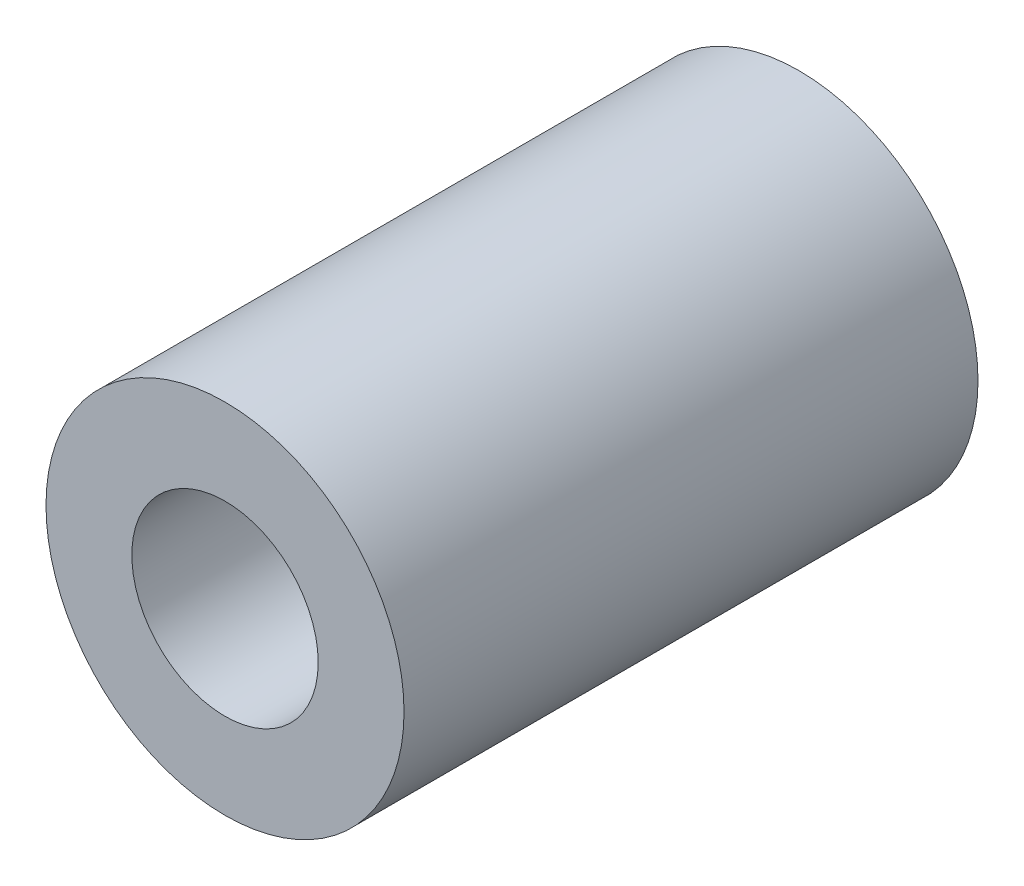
from build123d import *

# Parameters (mm, degrees)
BASE_EXTRUDE_DEPTH      = 6.4135
BASE_EXTRUDE_DEPTH_BACK = 6.4135
SKETCH1_R               = 4.0005
SKETCH2_R               = 2.0828
CUT_EXTRUDE1_DEPTH      = 15.019269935


with BuildPart() as part:
    # Sketch1 → Base-Extrude (new, two sides: drawn at the far end of the back side and taken through both)
    with BuildSketch(Plane.XY.offset(-BASE_EXTRUDE_DEPTH_BACK)):
        Circle(SKETCH1_R)
    extrude(amount=BASE_EXTRUDE_DEPTH + BASE_EXTRUDE_DEPTH_BACK)

    # Sketch2 → Cut-Extrude1 (cut, through all)
    with BuildSketch(Plane.XY.offset(6.4135)):
        Circle(SKETCH2_R)
    extrude(amount=-CUT_EXTRUDE1_DEPTH, mode=Mode.SUBTRACT)


solid = part.part
